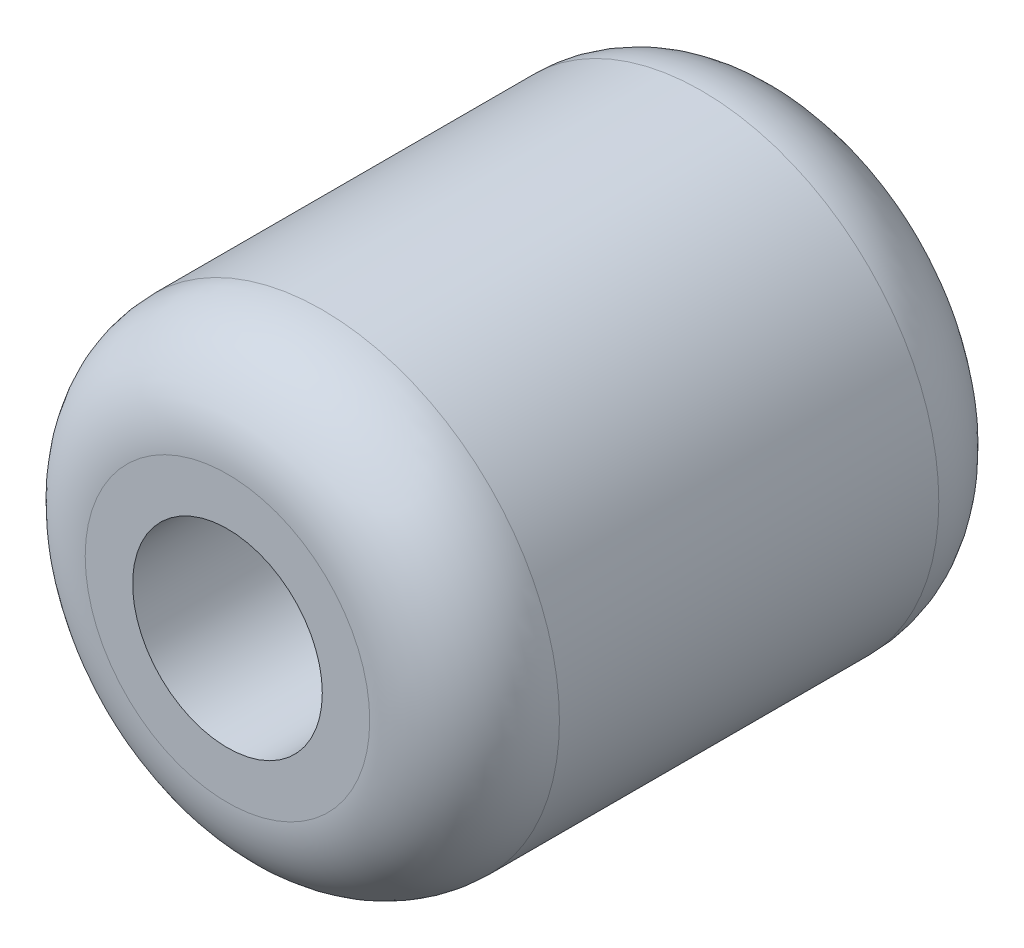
from build123d import *

# Parameters (mm, degrees)
ESQUISSE1_R            = 2.5
ESQUISSE1_R_2          = 1
CYLINDRE_PER_AGE_DEPTH = 6
ARRONDI_R              = 1


with BuildPart() as part:
    # Esquisse1 → cylindre_per_age (new body)
    with BuildSketch(Plane.XY):
        Circle(ESQUISSE1_R)
        Circle(ESQUISSE1_R_2, mode=Mode.SUBTRACT)
    extrude(amount=CYLINDRE_PER_AGE_DEPTH)

    # arrondi
    arrondi_edges = [part.edges().sort_by_distance(p)[0] for p in [
        (-2.5, 0, 0),
        (-2.5, 0, 6),
    ]]
    fillet(arrondi_edges, radius=ARRONDI_R)


solid = part.part
